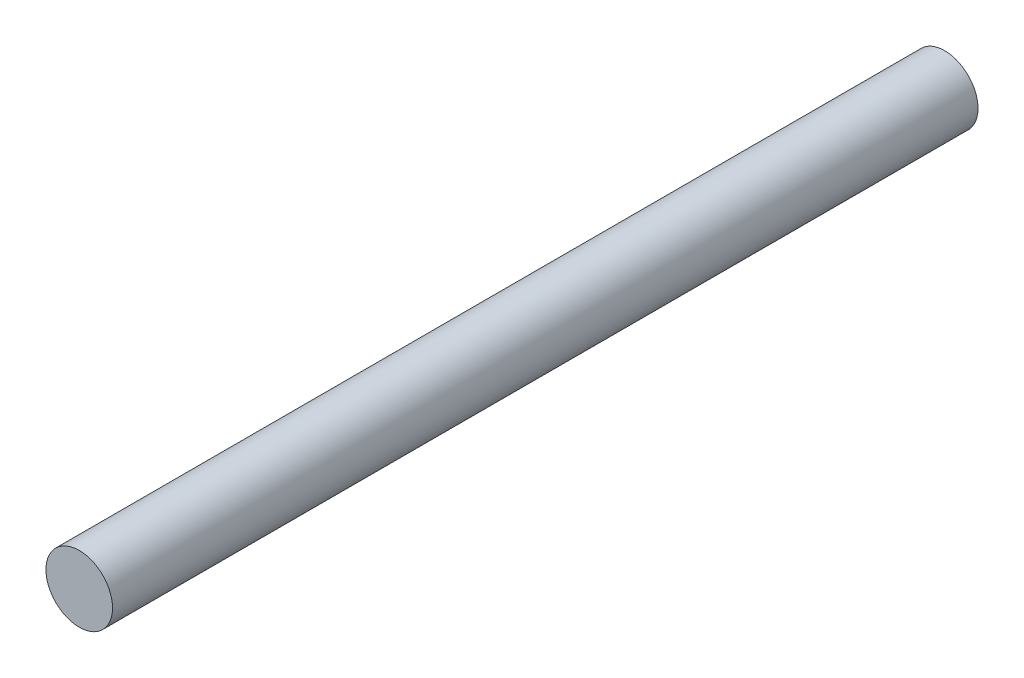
from build123d import *

# Parameters (mm, degrees)
SKETCH1_R      = 2.5
EXTRUDE1_DEPTH = 65


with BuildPart() as part:
    # Sketch1 → Extrude1 (new body)
    with BuildSketch(Plane.XY):
        Circle(SKETCH1_R)
    extrude(amount=EXTRUDE1_DEPTH)


solid = part.part
